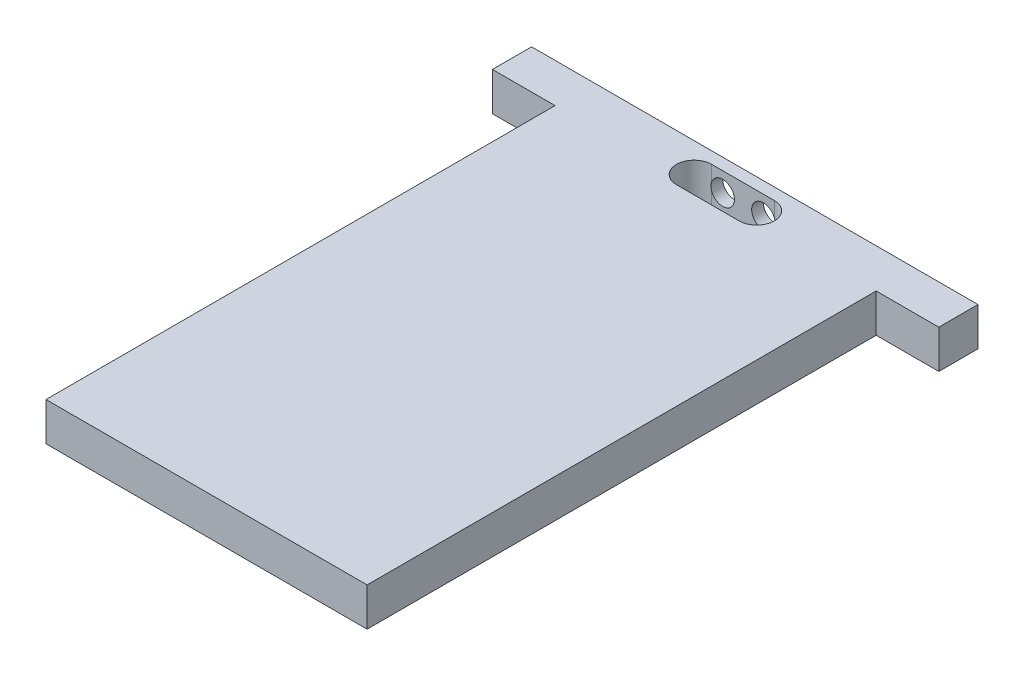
ISO-10303-21;
HEADER;
FILE_DESCRIPTION(('STEP AP214'),'2;1');
FILE_NAME('part.step','',(''),(''),'','','');
FILE_SCHEMA(('AUTOMOTIVE_DESIGN { 1 0 10303 214 1 1 1 1 }'));
ENDSEC;
DATA;
#1=APPLICATION_CONTEXT('core data for automotive mechanical design processes');
#2=APPLICATION_PROTOCOL_DEFINITION('international standard','automotive_design',2000,#1);
#3=PRODUCT_CONTEXT('',#1,'mechanical');
#4=PRODUCT('Part','Part','',(#3));
#5=PRODUCT_RELATED_PRODUCT_CATEGORY('part','',(#4));
#6=PRODUCT_DEFINITION_FORMATION('','',#4);
#7=PRODUCT_DEFINITION_CONTEXT('part definition',#1,'design');
#8=PRODUCT_DEFINITION('design','',#6,#7);
#9=PRODUCT_DEFINITION_SHAPE('','',#8);
#10=(LENGTH_UNIT() NAMED_UNIT(*) SI_UNIT(.MILLI.,.METRE.));
#11=(NAMED_UNIT(*) PLANE_ANGLE_UNIT() SI_UNIT($,.RADIAN.));
#12=(NAMED_UNIT(*) SI_UNIT($,.STERADIAN.) SOLID_ANGLE_UNIT());
#13=UNCERTAINTY_MEASURE_WITH_UNIT(LENGTH_MEASURE(1.E-05),#10,'distance_accuracy_value','');
#14=(GEOMETRIC_REPRESENTATION_CONTEXT(3) GLOBAL_UNCERTAINTY_ASSIGNED_CONTEXT((#13)) GLOBAL_UNIT_ASSIGNED_CONTEXT((#10,
#11,#12)) REPRESENTATION_CONTEXT('',''));
#15=CARTESIAN_POINT('',(0.,0.,0.));
#16=DIRECTION('',(0.,0.,1.));
#17=DIRECTION('',(1.,0.,0.));
#18=AXIS2_PLACEMENT_3D('',#15,#16,#17);
#19=CARTESIAN_POINT('',(20.5,-2.45,32.5));
#20=DIRECTION('',(-1.,0.,0.));
#21=DIRECTION('',(0.,0.,1.));
#22=AXIS2_PLACEMENT_3D('',#19,#20,#21);
#23=PLANE('',#22);
#24=DIRECTION('',(0.,1.,0.));
#25=VECTOR('',#24,1.);
#26=CARTESIAN_POINT('',(20.5,-2.45,-32.5));
#27=LINE('',#26,#25);
#28=CARTESIAN_POINT('',(20.5,-2.45,-32.5));
#29=VERTEX_POINT('',#28);
#30=CARTESIAN_POINT('',(20.5,2.45,-32.5));
#31=VERTEX_POINT('',#30);
#32=EDGE_CURVE('E191',#29,#31,#27,.T.);
#33=ORIENTED_EDGE('',*,*,#32,.T.);
#34=DIRECTION('',(0.,0.,-1.));
#35=VECTOR('',#34,1.);
#36=CARTESIAN_POINT('',(20.5,2.45,32.5));
#37=LINE('',#36,#35);
#38=CARTESIAN_POINT('',(20.5,2.45,32.5));
#39=VERTEX_POINT('',#38);
#40=EDGE_CURVE('E11',#39,#31,#37,.T.);
#41=ORIENTED_EDGE('',*,*,#40,.F.);
#42=DIRECTION('',(0.,1.,0.));
#43=VECTOR('',#42,1.);
#44=CARTESIAN_POINT('',(20.5,-2.45,32.5));
#45=LINE('',#44,#43);
#46=CARTESIAN_POINT('',(20.5,-2.45,32.5));
#47=VERTEX_POINT('',#46);
#48=EDGE_CURVE('E198',#47,#39,#45,.T.);
#49=ORIENTED_EDGE('',*,*,#48,.F.);
#50=DIRECTION('',(0.,0.,-1.));
#51=VECTOR('',#50,1.);
#52=CARTESIAN_POINT('',(20.5,-2.45,32.5));
#53=LINE('',#52,#51);
#54=EDGE_CURVE('E208',#47,#29,#53,.T.);
#55=ORIENTED_EDGE('',*,*,#54,.T.);
#56=EDGE_LOOP('',(#33,#41,#49,#55));
#57=FACE_BOUND('',#56,.T.);
#58=ADVANCED_FACE('F33',(#57),#23,.F.);
#59=CARTESIAN_POINT('',(-20.5,2.45,32.5));
#60=DIRECTION('',(0.,-1.,0.));
#61=DIRECTION('',(0.,0.,-1.));
#62=AXIS2_PLACEMENT_3D('',#59,#60,#61);
#63=PLANE('',#62);
#64=DIRECTION('',(1.,0.,0.));
#65=VECTOR('',#64,1.);
#66=CARTESIAN_POINT('',(-4.,2.45,-31.5));
#67=LINE('',#66,#65);
#68=CARTESIAN_POINT('',(-4.,2.45,-31.5));
#69=VERTEX_POINT('',#68);
#70=CARTESIAN_POINT('',(4.,2.45,-31.5));
#71=VERTEX_POINT('',#70);
#72=EDGE_CURVE('E330',#69,#71,#67,.T.);
#73=ORIENTED_EDGE('',*,*,#72,.F.);
#74=CARTESIAN_POINT('',(-4.,2.45,-33.75));
#75=DIRECTION('',(0.,1.,0.));
#76=DIRECTION('',(0.,0.,1.));
#77=AXIS2_PLACEMENT_3D('',#74,#75,#76);
#78=CIRCLE('',#77,2.25);
#79=CARTESIAN_POINT('',(-4.,2.45,-36.));
#80=VERTEX_POINT('',#79);
#81=EDGE_CURVE('E143',#80,#69,#78,.T.);
#82=ORIENTED_EDGE('',*,*,#81,.F.);
#83=DIRECTION('',(-1.,0.,0.));
#84=VECTOR('',#83,1.);
#85=CARTESIAN_POINT('',(-4.,2.45,-36.));
#86=LINE('',#85,#84);
#87=CARTESIAN_POINT('',(4.,2.45,-36.));
#88=VERTEX_POINT('',#87);
#89=EDGE_CURVE('E147',#88,#80,#86,.T.);
#90=ORIENTED_EDGE('',*,*,#89,.F.);
#91=CARTESIAN_POINT('',(4.,2.45,-33.75));
#92=DIRECTION('',(0.,1.,0.));
#93=DIRECTION('',(0.,0.,1.));
#94=AXIS2_PLACEMENT_3D('',#91,#92,#93);
#95=CIRCLE('',#94,2.25);
#96=EDGE_CURVE('E332',#71,#88,#95,.T.);
#97=ORIENTED_EDGE('',*,*,#96,.F.);
#98=EDGE_LOOP('',(#73,#82,#90,#97));
#99=FACE_BOUND('',#98,.T.);
#100=ORIENTED_EDGE('',*,*,#40,.T.);
#101=DIRECTION('',(-1.,0.,0.));
#102=VECTOR('',#101,1.);
#103=CARTESIAN_POINT('',(-28.5,2.45,-32.5));
#104=LINE('',#103,#102);
#105=CARTESIAN_POINT('',(28.5,2.45,-32.5));
#106=VERTEX_POINT('',#105);
#107=EDGE_CURVE('E181',#106,#31,#104,.T.);
#108=ORIENTED_EDGE('',*,*,#107,.F.);
#109=DIRECTION('',(0.,0.,1.));
#110=VECTOR('',#109,1.);
#111=CARTESIAN_POINT('',(28.5,2.45,-37.5));
#112=LINE('',#111,#110);
#113=CARTESIAN_POINT('',(28.5,2.45,-37.5));
#114=VERTEX_POINT('',#113);
#115=EDGE_CURVE('E177',#114,#106,#112,.T.);
#116=ORIENTED_EDGE('',*,*,#115,.F.);
#117=DIRECTION('',(-1.,0.,0.));
#118=VECTOR('',#117,1.);
#119=CARTESIAN_POINT('',(-28.5,2.45,-37.5));
#120=LINE('',#119,#118);
#121=CARTESIAN_POINT('',(-28.5,2.45,-37.5));
#122=VERTEX_POINT('',#121);
#123=EDGE_CURVE('E167',#114,#122,#120,.T.);
#124=ORIENTED_EDGE('',*,*,#123,.T.);
#125=DIRECTION('',(0.,0.,1.));
#126=VECTOR('',#125,1.);
#127=CARTESIAN_POINT('',(-28.5,2.45,-37.5));
#128=LINE('',#127,#126);
#129=CARTESIAN_POINT('',(-28.5,2.45,-32.5));
#130=VERTEX_POINT('',#129);
#131=EDGE_CURVE('E194',#122,#130,#128,.T.);
#132=ORIENTED_EDGE('',*,*,#131,.T.);
#133=CARTESIAN_POINT('',(-20.5,2.45,-32.5));
#134=VERTEX_POINT('',#133);
#135=EDGE_CURVE('E180',#134,#130,#104,.T.);
#136=ORIENTED_EDGE('',*,*,#135,.F.);
#137=DIRECTION('',(0.,0.,-1.));
#138=VECTOR('',#137,1.);
#139=CARTESIAN_POINT('',(-20.5,2.45,32.5));
#140=LINE('',#139,#138);
#141=CARTESIAN_POINT('',(-20.5,2.45,32.5));
#142=VERTEX_POINT('',#141);
#143=EDGE_CURVE('E40',#142,#134,#140,.T.);
#144=ORIENTED_EDGE('',*,*,#143,.F.);
#145=DIRECTION('',(-1.,0.,0.));
#146=VECTOR('',#145,1.);
#147=CARTESIAN_POINT('',(-20.5,2.45,32.5));
#148=LINE('',#147,#146);
#149=EDGE_CURVE('E201',#39,#142,#148,.T.);
#150=ORIENTED_EDGE('',*,*,#149,.F.);
#151=EDGE_LOOP('',(#100,#108,#116,#124,#132,#136,#144,#150));
#152=FACE_BOUND('',#151,.T.);
#153=ADVANCED_FACE('F225',(#99,#152),#63,.F.);
#154=CARTESIAN_POINT('',(-20.5,-2.45,32.5));
#155=DIRECTION('',(1.,0.,0.));
#156=DIRECTION('',(0.,0.,-1.));
#157=AXIS2_PLACEMENT_3D('',#154,#155,#156);
#158=PLANE('',#157);
#159=DIRECTION('',(0.,-1.,0.));
#160=VECTOR('',#159,1.);
#161=CARTESIAN_POINT('',(-20.5,-2.45,-32.5));
#162=LINE('',#161,#160);
#163=CARTESIAN_POINT('',(-20.5,-2.45,-32.5));
#164=VERTEX_POINT('',#163);
#165=EDGE_CURVE('E202',#134,#164,#162,.T.);
#166=ORIENTED_EDGE('',*,*,#165,.T.);
#167=DIRECTION('',(0.,0.,-1.));
#168=VECTOR('',#167,1.);
#169=CARTESIAN_POINT('',(-20.5,-2.45,32.5));
#170=LINE('',#169,#168);
#171=CARTESIAN_POINT('',(-20.5,-2.45,32.5));
#172=VERTEX_POINT('',#171);
#173=EDGE_CURVE('E215',#172,#164,#170,.T.);
#174=ORIENTED_EDGE('',*,*,#173,.F.);
#175=DIRECTION('',(0.,-1.,0.));
#176=VECTOR('',#175,1.);
#177=CARTESIAN_POINT('',(-20.5,-2.45,32.5));
#178=LINE('',#177,#176);
#179=EDGE_CURVE('E204',#142,#172,#178,.T.);
#180=ORIENTED_EDGE('',*,*,#179,.F.);
#181=ORIENTED_EDGE('',*,*,#143,.T.);
#182=EDGE_LOOP('',(#166,#174,#180,#181));
#183=FACE_BOUND('',#182,.T.);
#184=ADVANCED_FACE('F221',(#183),#158,.F.);
#185=CARTESIAN_POINT('',(-20.5,-2.45,32.5));
#186=DIRECTION('',(0.,1.,0.));
#187=DIRECTION('',(0.,0.,1.));
#188=AXIS2_PLACEMENT_3D('',#185,#186,#187);
#189=PLANE('',#188);
#190=DIRECTION('',(-1.,0.,0.));
#191=VECTOR('',#190,1.);
#192=CARTESIAN_POINT('',(-4.,-2.45,-36.));
#193=LINE('',#192,#191);
#194=CARTESIAN_POINT('',(4.,-2.45,-36.));
#195=VERTEX_POINT('',#194);
#196=CARTESIAN_POINT('',(-4.,-2.45,-36.));
#197=VERTEX_POINT('',#196);
#198=EDGE_CURVE('E163',#195,#197,#193,.T.);
#199=ORIENTED_EDGE('',*,*,#198,.T.);
#200=CARTESIAN_POINT('',(-4.,-2.45,-33.75));
#201=DIRECTION('',(0.,1.,0.));
#202=DIRECTION('',(0.,0.,1.));
#203=AXIS2_PLACEMENT_3D('',#200,#201,#202);
#204=CIRCLE('',#203,2.25);
#205=CARTESIAN_POINT('',(-4.,-2.45,-31.5));
#206=VERTEX_POINT('',#205);
#207=EDGE_CURVE('E318',#197,#206,#204,.T.);
#208=ORIENTED_EDGE('',*,*,#207,.T.);
#209=DIRECTION('',(1.,0.,0.));
#210=VECTOR('',#209,1.);
#211=CARTESIAN_POINT('',(-4.,-2.45,-31.5));
#212=LINE('',#211,#210);
#213=CARTESIAN_POINT('',(4.,-2.45,-31.5));
#214=VERTEX_POINT('',#213);
#215=EDGE_CURVE('E321',#206,#214,#212,.T.);
#216=ORIENTED_EDGE('',*,*,#215,.T.);
#217=CARTESIAN_POINT('',(4.,-2.45,-33.75));
#218=DIRECTION('',(0.,1.,0.));
#219=DIRECTION('',(0.,0.,1.));
#220=AXIS2_PLACEMENT_3D('',#217,#218,#219);
#221=CIRCLE('',#220,2.25);
#222=EDGE_CURVE('E324',#214,#195,#221,.T.);
#223=ORIENTED_EDGE('',*,*,#222,.T.);
#224=EDGE_LOOP('',(#199,#208,#216,#223));
#225=FACE_BOUND('',#224,.T.);
#226=ORIENTED_EDGE('',*,*,#173,.T.);
#227=DIRECTION('',(1.,0.,0.));
#228=VECTOR('',#227,1.);
#229=CARTESIAN_POINT('',(-28.5,-2.45,-32.5));
#230=LINE('',#229,#228);
#231=CARTESIAN_POINT('',(-28.5,-2.45,-32.5));
#232=VERTEX_POINT('',#231);
#233=EDGE_CURVE('E168',#232,#164,#230,.T.);
#234=ORIENTED_EDGE('',*,*,#233,.F.);
#235=DIRECTION('',(0.,0.,1.));
#236=VECTOR('',#235,1.);
#237=CARTESIAN_POINT('',(-28.5,-2.45,-37.5));
#238=LINE('',#237,#236);
#239=CARTESIAN_POINT('',(-28.5,-2.45,-37.5));
#240=VERTEX_POINT('',#239);
#241=EDGE_CURVE('E192',#240,#232,#238,.T.);
#242=ORIENTED_EDGE('',*,*,#241,.F.);
#243=DIRECTION('',(1.,0.,0.));
#244=VECTOR('',#243,1.);
#245=CARTESIAN_POINT('',(-28.5,-2.45,-37.5));
#246=LINE('',#245,#244);
#247=CARTESIAN_POINT('',(28.5,-2.45,-37.5));
#248=VERTEX_POINT('',#247);
#249=EDGE_CURVE('E174',#240,#248,#246,.T.);
#250=ORIENTED_EDGE('',*,*,#249,.T.);
#251=DIRECTION('',(0.,0.,1.));
#252=VECTOR('',#251,1.);
#253=CARTESIAN_POINT('',(28.5,-2.45,-37.5));
#254=LINE('',#253,#252);
#255=CARTESIAN_POINT('',(28.5,-2.45,-32.5));
#256=VERTEX_POINT('',#255);
#257=EDGE_CURVE('E188',#248,#256,#254,.T.);
#258=ORIENTED_EDGE('',*,*,#257,.T.);
#259=EDGE_CURVE('E186',#29,#256,#230,.T.);
#260=ORIENTED_EDGE('',*,*,#259,.F.);
#261=ORIENTED_EDGE('',*,*,#54,.F.);
#262=DIRECTION('',(1.,0.,0.));
#263=VECTOR('',#262,1.);
#264=CARTESIAN_POINT('',(-20.5,-2.45,32.5));
#265=LINE('',#264,#263);
#266=EDGE_CURVE('E206',#172,#47,#265,.T.);
#267=ORIENTED_EDGE('',*,*,#266,.F.);
#268=EDGE_LOOP('',(#226,#234,#242,#250,#258,#260,#261,#267));
#269=FACE_BOUND('',#268,.T.);
#270=ADVANCED_FACE('F231',(#225,#269),#189,.F.);
#271=CARTESIAN_POINT('',(0.,0.,32.5));
#272=DIRECTION('',(0.,0.,-1.));
#273=DIRECTION('',(-1.,0.,0.));
#274=AXIS2_PLACEMENT_3D('',#271,#272,#273);
#275=PLANE('',#274);
#276=ORIENTED_EDGE('',*,*,#48,.T.);
#277=ORIENTED_EDGE('',*,*,#149,.T.);
#278=ORIENTED_EDGE('',*,*,#179,.T.);
#279=ORIENTED_EDGE('',*,*,#266,.T.);
#280=EDGE_LOOP('',(#276,#277,#278,#279));
#281=FACE_BOUND('',#280,.T.);
#282=ADVANCED_FACE('F237',(#281),#275,.F.);
#283=CARTESIAN_POINT('',(0.,0.,-32.5));
#284=DIRECTION('',(0.,0.,-1.));
#285=DIRECTION('',(-1.,0.,0.));
#286=AXIS2_PLACEMENT_3D('',#283,#284,#285);
#287=PLANE('',#286);
#288=ORIENTED_EDGE('',*,*,#32,.F.);
#289=ORIENTED_EDGE('',*,*,#259,.T.);
#290=DIRECTION('',(0.,1.,0.));
#291=VECTOR('',#290,1.);
#292=CARTESIAN_POINT('',(28.5,-2.45,-32.5));
#293=LINE('',#292,#291);
#294=EDGE_CURVE('E151',#256,#106,#293,.T.);
#295=ORIENTED_EDGE('',*,*,#294,.T.);
#296=ORIENTED_EDGE('',*,*,#107,.T.);
#297=EDGE_LOOP('',(#288,#289,#295,#296));
#298=FACE_BOUND('',#297,.T.);
#299=ADVANCED_FACE('F244',(#298),#287,.F.);
#300=CARTESIAN_POINT('',(28.5,-2.45,-37.5));
#301=DIRECTION('',(1.,0.,0.));
#302=DIRECTION('',(0.,0.,-1.));
#303=AXIS2_PLACEMENT_3D('',#300,#301,#302);
#304=PLANE('',#303);
#305=ORIENTED_EDGE('',*,*,#294,.F.);
#306=ORIENTED_EDGE('',*,*,#257,.F.);
#307=DIRECTION('',(0.,1.,0.));
#308=VECTOR('',#307,1.);
#309=CARTESIAN_POINT('',(28.5,-2.45,-37.5));
#310=LINE('',#309,#308);
#311=EDGE_CURVE('E164',#248,#114,#310,.T.);
#312=ORIENTED_EDGE('',*,*,#311,.T.);
#313=ORIENTED_EDGE('',*,*,#115,.T.);
#314=EDGE_LOOP('',(#305,#306,#312,#313));
#315=FACE_BOUND('',#314,.T.);
#316=ADVANCED_FACE('F246',(#315),#304,.T.);
#317=CARTESIAN_POINT('',(-28.5,-2.45,-37.5));
#318=DIRECTION('',(-1.,0.,0.));
#319=DIRECTION('',(0.,0.,1.));
#320=AXIS2_PLACEMENT_3D('',#317,#318,#319);
#321=PLANE('',#320);
#322=DIRECTION('',(0.,-1.,0.));
#323=VECTOR('',#322,1.);
#324=CARTESIAN_POINT('',(-28.5,-2.45,-32.5));
#325=LINE('',#324,#323);
#326=EDGE_CURVE('E183',#130,#232,#325,.T.);
#327=ORIENTED_EDGE('',*,*,#326,.F.);
#328=ORIENTED_EDGE('',*,*,#131,.F.);
#329=DIRECTION('',(0.,-1.,0.));
#330=VECTOR('',#329,1.);
#331=CARTESIAN_POINT('',(-28.5,-2.45,-37.5));
#332=LINE('',#331,#330);
#333=EDGE_CURVE('E171',#122,#240,#332,.T.);
#334=ORIENTED_EDGE('',*,*,#333,.T.);
#335=ORIENTED_EDGE('',*,*,#241,.T.);
#336=EDGE_LOOP('',(#327,#328,#334,#335));
#337=FACE_BOUND('',#336,.T.);
#338=ADVANCED_FACE('F253',(#337),#321,.T.);
#339=CARTESIAN_POINT('',(0.,0.,-37.5));
#340=DIRECTION('',(0.,0.,-1.));
#341=DIRECTION('',(-1.,0.,0.));
#342=AXIS2_PLACEMENT_3D('',#339,#340,#341);
#343=PLANE('',#342);
#344=CARTESIAN_POINT('',(-2.6,0.,-37.5));
#345=DIRECTION('',(0.,0.,-1.));
#346=DIRECTION('',(-1.,0.,0.));
#347=AXIS2_PLACEMENT_3D('',#344,#345,#346);
#348=CIRCLE('',#347,1.5);
#349=CARTESIAN_POINT('',(-4.1,0.,-37.5));
#350=VERTEX_POINT('',#349);
#351=EDGE_CURVE('E135',#350,#350,#348,.T.);
#352=ORIENTED_EDGE('',*,*,#351,.F.);
#353=EDGE_LOOP('',(#352));
#354=FACE_BOUND('',#353,.T.);
#355=CARTESIAN_POINT('',(2.6,0.,-37.5));
#356=DIRECTION('',(0.,0.,-1.));
#357=DIRECTION('',(1.,0.,0.));
#358=AXIS2_PLACEMENT_3D('',#355,#356,#357);
#359=CIRCLE('',#358,1.5);
#360=CARTESIAN_POINT('',(4.1,0.,-37.5));
#361=VERTEX_POINT('',#360);
#362=EDGE_CURVE('E316',#361,#361,#359,.T.);
#363=ORIENTED_EDGE('',*,*,#362,.F.);
#364=EDGE_LOOP('',(#363));
#365=FACE_BOUND('',#364,.T.);
#366=ORIENTED_EDGE('',*,*,#311,.F.);
#367=ORIENTED_EDGE('',*,*,#249,.F.);
#368=ORIENTED_EDGE('',*,*,#333,.F.);
#369=ORIENTED_EDGE('',*,*,#123,.F.);
#370=EDGE_LOOP('',(#366,#367,#368,#369));
#371=FACE_BOUND('',#370,.T.);
#372=ADVANCED_FACE('F250',(#354,#365,#371),#343,.T.);
#373=ORIENTED_EDGE('',*,*,#165,.F.);
#374=ORIENTED_EDGE('',*,*,#135,.T.);
#375=ORIENTED_EDGE('',*,*,#326,.T.);
#376=ORIENTED_EDGE('',*,*,#233,.T.);
#377=EDGE_LOOP('',(#373,#374,#375,#376));
#378=FACE_BOUND('',#377,.T.);
#379=ADVANCED_FACE('F228',(#378),#287,.F.);
#380=CARTESIAN_POINT('',(-4.,-2.45,-33.75));
#381=DIRECTION('',(0.,1.,0.));
#382=DIRECTION('',(0.,0.,1.));
#383=AXIS2_PLACEMENT_3D('',#380,#381,#382);
#384=CYLINDRICAL_SURFACE('',#383,2.25);
#385=DIRECTION('',(0.,1.,0.));
#386=VECTOR('',#385,1.);
#387=CARTESIAN_POINT('',(-4.,-2.45,-36.));
#388=LINE('',#387,#386);
#389=CARTESIAN_POINT('',(-4.,-0.538516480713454,-36.));
#390=VERTEX_POINT('',#389);
#391=EDGE_CURVE('E142',#197,#390,#388,.T.);
#392=ORIENTED_EDGE('',*,*,#391,.T.);
#393=CARTESIAN_POINT('',(-4.,0.538516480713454,-36.));
#394=CARTESIAN_POINT('',(-4.01513091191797,0.499191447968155,-35.9999927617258));
#395=CARTESIAN_POINT('',(-4.02859637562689,0.459228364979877,-35.9998471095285));
#396=CARTESIAN_POINT('',(-4.05211989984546,0.378311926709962,-35.9994289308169));
#397=CARTESIAN_POINT('',(-4.06217794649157,0.337358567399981,-35.9991564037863));
#398=CARTESIAN_POINT('',(-4.0788215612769,0.254690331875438,-35.9986340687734));
#399=CARTESIAN_POINT('',(-4.08540228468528,0.212974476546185,-35.9983842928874));
#400=CARTESIAN_POINT('',(-4.09502583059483,0.129148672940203,-35.9979971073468));
#401=CARTESIAN_POINT('',(-4.09806887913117,0.0870387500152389,-35.9978596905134));
#402=CARTESIAN_POINT('',(-4.10184920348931,-0.03949184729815,-35.9976999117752));
#403=CARTESIAN_POINT('',(-4.09724076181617,-0.124128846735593,-35.9979298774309));
#404=CARTESIAN_POINT('',(-4.07386808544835,-0.291217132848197,-35.9988158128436));
#405=CARTESIAN_POINT('',(-4.05514196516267,-0.373673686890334,-35.9994706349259));
#406=CARTESIAN_POINT('',(-4.02516163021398,-0.468123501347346,-35.9998634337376));
#407=CARTESIAN_POINT('',(-4.02042173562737,-0.482313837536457,-35.9999125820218));
#408=CARTESIAN_POINT('',(-4.01052404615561,-0.51053357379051,-35.9999810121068));
#409=CARTESIAN_POINT('',(-4.00536663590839,-0.524563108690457,-36.0000003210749));
#410=CARTESIAN_POINT('',(-4.,-0.538516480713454,-36.));
#411=B_SPLINE_CURVE_WITH_KNOTS('',3,(#393,#394,#395,#396,#397,#398,#399,#400,#401,#402,#403,
#404,#405,#406,#407,#408,#409,#410),.UNSPECIFIED.,.F.,.F.,(4,2,2,2,2,2,2,2,4),(0.,
0.126364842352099,0.25273019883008,0.379271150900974,0.505804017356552,0.758822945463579,
1.01116121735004,1.05604186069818,1.10088161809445),.UNSPECIFIED.);
#412=CARTESIAN_POINT('',(-4.,0.538516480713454,-36.));
#413=VERTEX_POINT('',#412);
#414=EDGE_CURVE('E46',#413,#390,#411,.T.);
#415=ORIENTED_EDGE('',*,*,#414,.F.);
#416=EDGE_CURVE('E139',#413,#80,#388,.T.);
#417=ORIENTED_EDGE('',*,*,#416,.T.);
#418=ORIENTED_EDGE('',*,*,#81,.T.);
#419=DIRECTION('',(0.,1.,0.));
#420=VECTOR('',#419,1.);
#421=CARTESIAN_POINT('',(-4.,-2.45,-31.5));
#422=LINE('',#421,#420);
#423=EDGE_CURVE('E160',#206,#69,#422,.T.);
#424=ORIENTED_EDGE('',*,*,#423,.F.);
#425=ORIENTED_EDGE('',*,*,#207,.F.);
#426=EDGE_LOOP('',(#392,#415,#417,#418,#424,#425));
#427=FACE_BOUND('',#426,.T.);
#428=ADVANCED_FACE('F138',(#427),#384,.F.);
#429=CARTESIAN_POINT('',(-4.,-2.45,-36.));
#430=DIRECTION('',(0.,0.,-1.));
#431=DIRECTION('',(-1.,0.,0.));
#432=AXIS2_PLACEMENT_3D('',#429,#430,#431);
#433=PLANE('',#432);
#434=ORIENTED_EDGE('',*,*,#416,.F.);
#435=CARTESIAN_POINT('',(-2.6,0.,-36.));
#436=DIRECTION('',(0.,0.,-1.));
#437=DIRECTION('',(-1.,0.,0.));
#438=AXIS2_PLACEMENT_3D('',#435,#436,#437);
#439=CIRCLE('',#438,1.5);
#440=EDGE_CURVE('E130',#390,#413,#439,.F.);
#441=ORIENTED_EDGE('',*,*,#440,.F.);
#442=ORIENTED_EDGE('',*,*,#391,.F.);
#443=ORIENTED_EDGE('',*,*,#198,.F.);
#444=DIRECTION('',(0.,1.,0.));
#445=VECTOR('',#444,1.);
#446=CARTESIAN_POINT('',(4.,-2.45,-36.));
#447=LINE('',#446,#445);
#448=CARTESIAN_POINT('',(4.,-0.538516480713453,-36.));
#449=VERTEX_POINT('',#448);
#450=EDGE_CURVE('E149',#195,#449,#447,.T.);
#451=ORIENTED_EDGE('',*,*,#450,.T.);
#452=CARTESIAN_POINT('',(2.6,0.,-36.));
#453=DIRECTION('',(0.,0.,-1.));
#454=DIRECTION('',(-1.,0.,0.));
#455=AXIS2_PLACEMENT_3D('',#452,#453,#454);
#456=CIRCLE('',#455,1.5);
#457=CARTESIAN_POINT('',(4.,0.538516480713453,-36.));
#458=VERTEX_POINT('',#457);
#459=EDGE_CURVE('E53',#458,#449,#456,.F.);
#460=ORIENTED_EDGE('',*,*,#459,.F.);
#461=EDGE_CURVE('E153',#458,#88,#447,.T.);
#462=ORIENTED_EDGE('',*,*,#461,.T.);
#463=ORIENTED_EDGE('',*,*,#89,.T.);
#464=EDGE_LOOP('',(#434,#441,#442,#443,#451,#460,#462,#463));
#465=FACE_BOUND('',#464,.T.);
#466=ADVANCED_FACE('F145',(#465),#433,.F.);
#467=CARTESIAN_POINT('',(4.,-2.45,-33.75));
#468=DIRECTION('',(0.,1.,0.));
#469=DIRECTION('',(0.,0.,1.));
#470=AXIS2_PLACEMENT_3D('',#467,#468,#469);
#471=CYLINDRICAL_SURFACE('',#470,2.25);
#472=ORIENTED_EDGE('',*,*,#461,.F.);
#473=CARTESIAN_POINT('',(4.,-0.538516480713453,-36.));
#474=CARTESIAN_POINT('',(4.01513091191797,-0.499191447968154,-35.9999927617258));
#475=CARTESIAN_POINT('',(4.02859637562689,-0.459228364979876,-35.9998471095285));
#476=CARTESIAN_POINT('',(4.05211989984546,-0.378311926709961,-35.9994289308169));
#477=CARTESIAN_POINT('',(4.06217794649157,-0.33735856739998,-35.9991564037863));
#478=CARTESIAN_POINT('',(4.0788215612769,-0.254690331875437,-35.9986340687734));
#479=CARTESIAN_POINT('',(4.08540228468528,-0.212974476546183,-35.9983842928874));
#480=CARTESIAN_POINT('',(4.09502583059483,-0.129148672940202,-35.9979971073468));
#481=CARTESIAN_POINT('',(4.09806887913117,-0.0870387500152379,-35.9978596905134));
#482=CARTESIAN_POINT('',(4.10184920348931,0.039491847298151,-35.9976999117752));
#483=CARTESIAN_POINT('',(4.09724076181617,0.124128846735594,-35.9979298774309));
#484=CARTESIAN_POINT('',(4.07386808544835,0.291217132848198,-35.9988158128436));
#485=CARTESIAN_POINT('',(4.05514196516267,0.373673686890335,-35.9994706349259));
#486=CARTESIAN_POINT('',(4.02516163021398,0.468123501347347,-35.9998634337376));
#487=CARTESIAN_POINT('',(4.02042173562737,0.482313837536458,-35.9999125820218));
#488=CARTESIAN_POINT('',(4.01052404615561,0.51053357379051,-35.9999810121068));
#489=CARTESIAN_POINT('',(4.00536663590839,0.524563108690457,-36.0000003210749));
#490=CARTESIAN_POINT('',(4.,0.538516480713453,-36.));
#491=B_SPLINE_CURVE_WITH_KNOTS('',3,(#473,#474,#475,#476,#477,#478,#479,#480,#481,#482,#483,
#484,#485,#486,#487,#488,#489,#490),.UNSPECIFIED.,.F.,.F.,(4,2,2,2,2,2,2,2,4),(0.,
0.126364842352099,0.25273019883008,0.379271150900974,0.505804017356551,0.758822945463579,
1.01116121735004,1.05604186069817,1.10088161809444),.UNSPECIFIED.);
#492=EDGE_CURVE('E310',#449,#458,#491,.T.);
#493=ORIENTED_EDGE('',*,*,#492,.F.);
#494=ORIENTED_EDGE('',*,*,#450,.F.);
#495=ORIENTED_EDGE('',*,*,#222,.F.);
#496=DIRECTION('',(0.,1.,0.));
#497=VECTOR('',#496,1.);
#498=CARTESIAN_POINT('',(4.,-2.45,-31.5));
#499=LINE('',#498,#497);
#500=EDGE_CURVE('E158',#214,#71,#499,.T.);
#501=ORIENTED_EDGE('',*,*,#500,.T.);
#502=ORIENTED_EDGE('',*,*,#96,.T.);
#503=EDGE_LOOP('',(#472,#493,#494,#495,#501,#502));
#504=FACE_BOUND('',#503,.T.);
#505=ADVANCED_FACE('F292',(#504),#471,.F.);
#506=CARTESIAN_POINT('',(-4.,-2.45,-31.5));
#507=DIRECTION('',(0.,0.,1.));
#508=DIRECTION('',(1.,0.,0.));
#509=AXIS2_PLACEMENT_3D('',#506,#507,#508);
#510=PLANE('',#509);
#511=ORIENTED_EDGE('',*,*,#72,.T.);
#512=ORIENTED_EDGE('',*,*,#500,.F.);
#513=ORIENTED_EDGE('',*,*,#215,.F.);
#514=ORIENTED_EDGE('',*,*,#423,.T.);
#515=EDGE_LOOP('',(#511,#512,#513,#514));
#516=FACE_BOUND('',#515,.T.);
#517=ADVANCED_FACE('F295',(#516),#510,.F.);
#518=CARTESIAN_POINT('',(2.6,0.,32.501));
#519=DIRECTION('',(0.,0.,-1.));
#520=DIRECTION('',(-1.,0.,0.));
#521=AXIS2_PLACEMENT_3D('',#518,#519,#520);
#522=CYLINDRICAL_SURFACE('',#521,1.5);
#523=ORIENTED_EDGE('',*,*,#362,.T.);
#524=EDGE_LOOP('',(#523));
#525=FACE_BOUND('',#524,.T.);
#526=ORIENTED_EDGE('',*,*,#459,.T.);
#527=ORIENTED_EDGE('',*,*,#492,.T.);
#528=EDGE_LOOP('',(#526,#527));
#529=FACE_BOUND('',#528,.T.);
#530=ADVANCED_FACE('F298',(#525,#529),#522,.F.);
#531=CARTESIAN_POINT('',(-2.6,0.,32.501));
#532=DIRECTION('',(0.,0.,-1.));
#533=DIRECTION('',(-1.,0.,0.));
#534=AXIS2_PLACEMENT_3D('',#531,#532,#533);
#535=CYLINDRICAL_SURFACE('',#534,1.5);
#536=ORIENTED_EDGE('',*,*,#351,.T.);
#537=EDGE_LOOP('',(#536));
#538=FACE_BOUND('',#537,.T.);
#539=ORIENTED_EDGE('',*,*,#414,.T.);
#540=ORIENTED_EDGE('',*,*,#440,.T.);
#541=EDGE_LOOP('',(#539,#540));
#542=FACE_BOUND('',#541,.T.);
#543=ADVANCED_FACE('F131',(#538,#542),#535,.F.);
#544=CLOSED_SHELL('',(#58,#153,#184,#270,#282,#299,#316,#338,#372,#379,#428,#466,#505,#517,#530,#543));
#545=MANIFOLD_SOLID_BREP('B2',#544);
#546=ADVANCED_BREP_SHAPE_REPRESENTATION('',(#18,#545),#14);
#547=SHAPE_DEFINITION_REPRESENTATION(#9,#546);
ENDSEC;
END-ISO-10303-21;
